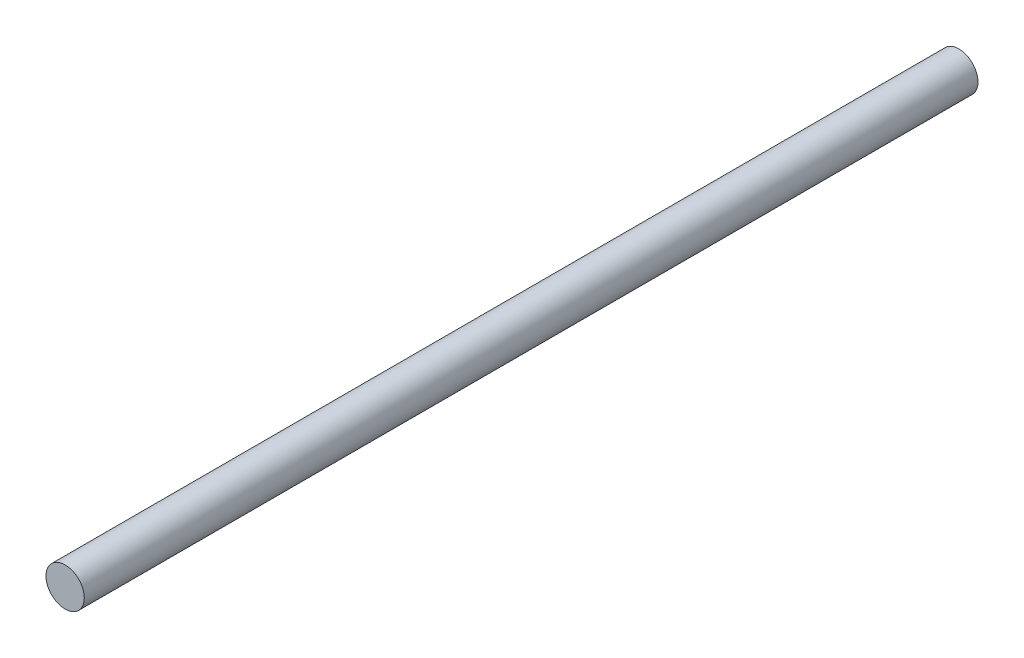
from build123d import *

# Parameters (mm, degrees)
SKETCH1_R           = 30
BOSS_EXTRUDE1_DEPTH = 1400


with BuildPart() as part:
    # Sketch1 → Boss-Extrude1 (new body)
    with BuildSketch(Plane.XY):
        Circle(SKETCH1_R)
    extrude(amount=-BOSS_EXTRUDE1_DEPTH)


solid = part.part
